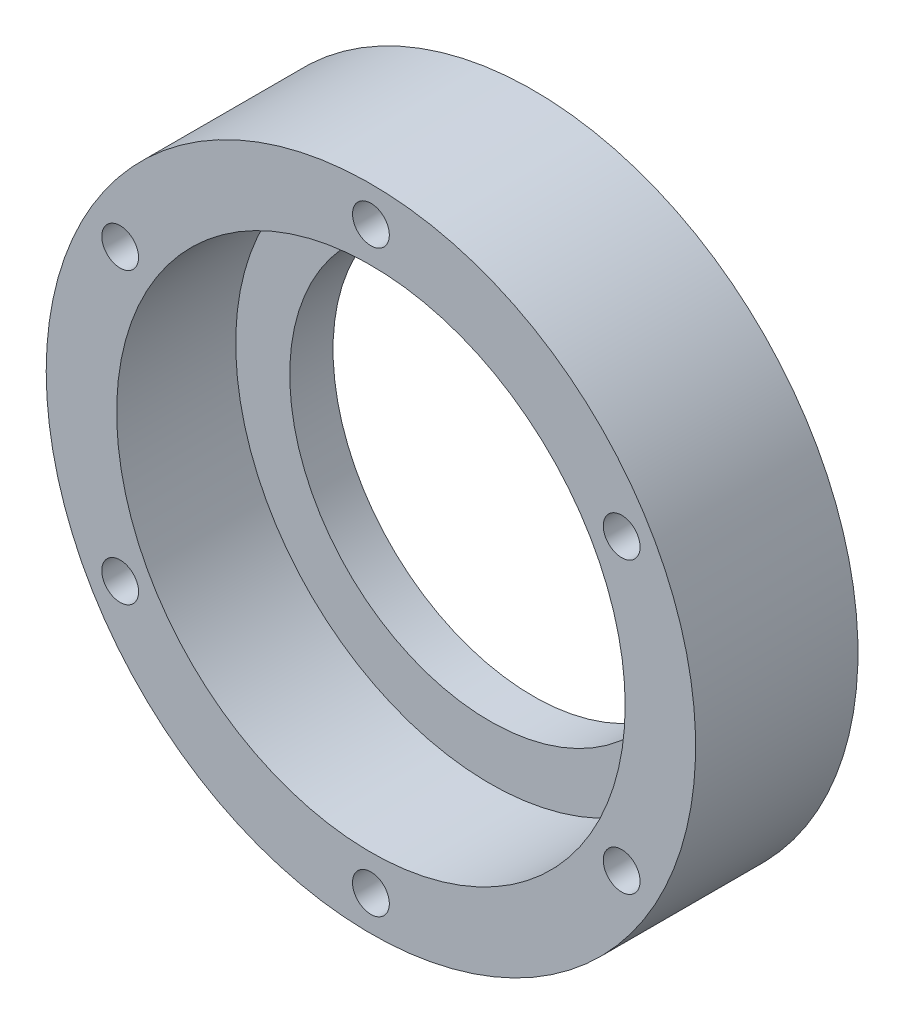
ISO-10303-21;
HEADER;
FILE_DESCRIPTION(('STEP AP214'),'2;1');
FILE_NAME('part.step','',(''),(''),'','','');
FILE_SCHEMA(('AUTOMOTIVE_DESIGN { 1 0 10303 214 1 1 1 1 }'));
ENDSEC;
DATA;
#1=APPLICATION_CONTEXT('core data for automotive mechanical design processes');
#2=APPLICATION_PROTOCOL_DEFINITION('international standard','automotive_design',2000,#1);
#3=PRODUCT_CONTEXT('',#1,'mechanical');
#4=PRODUCT('Part','Part','',(#3));
#5=PRODUCT_RELATED_PRODUCT_CATEGORY('part','',(#4));
#6=PRODUCT_DEFINITION_FORMATION('','',#4);
#7=PRODUCT_DEFINITION_CONTEXT('part definition',#1,'design');
#8=PRODUCT_DEFINITION('design','',#6,#7);
#9=PRODUCT_DEFINITION_SHAPE('','',#8);
#10=(LENGTH_UNIT() NAMED_UNIT(*) SI_UNIT(.MILLI.,.METRE.));
#11=(NAMED_UNIT(*) PLANE_ANGLE_UNIT() SI_UNIT($,.RADIAN.));
#12=(NAMED_UNIT(*) SI_UNIT($,.STERADIAN.) SOLID_ANGLE_UNIT());
#13=UNCERTAINTY_MEASURE_WITH_UNIT(LENGTH_MEASURE(1.E-05),#10,'distance_accuracy_value','');
#14=(GEOMETRIC_REPRESENTATION_CONTEXT(3) GLOBAL_UNCERTAINTY_ASSIGNED_CONTEXT((#13)) GLOBAL_UNIT_ASSIGNED_CONTEXT((#10,
#11,#12)) REPRESENTATION_CONTEXT('',''));
#15=CARTESIAN_POINT('',(0.,0.,0.));
#16=DIRECTION('',(0.,0.,1.));
#17=DIRECTION('',(1.,0.,0.));
#18=AXIS2_PLACEMENT_3D('',#15,#16,#17);
#19=CARTESIAN_POINT('',(0.,0.,15.));
#20=DIRECTION('',(0.,0.,-1.));
#21=DIRECTION('',(-1.,0.,0.));
#22=AXIS2_PLACEMENT_3D('',#19,#20,#21);
#23=CYLINDRICAL_SURFACE('',#22,30.);
#24=CARTESIAN_POINT('',(0.,0.,15.));
#25=DIRECTION('',(0.,0.,-1.));
#26=DIRECTION('',(-1.,0.,0.));
#27=AXIS2_PLACEMENT_3D('',#24,#25,#26);
#28=CIRCLE('',#27,30.);
#29=CARTESIAN_POINT('',(-30.,0.,15.));
#30=VERTEX_POINT('',#29);
#31=EDGE_CURVE('E75',#30,#30,#28,.T.);
#32=ORIENTED_EDGE('',*,*,#31,.T.);
#33=EDGE_LOOP('',(#32));
#34=FACE_BOUND('',#33,.T.);
#35=CARTESIAN_POINT('',(0.,0.,0.));
#36=DIRECTION('',(0.,0.,-1.));
#37=DIRECTION('',(-1.,0.,0.));
#38=AXIS2_PLACEMENT_3D('',#35,#36,#37);
#39=CIRCLE('',#38,30.);
#40=CARTESIAN_POINT('',(-30.,0.,0.));
#41=VERTEX_POINT('',#40);
#42=EDGE_CURVE('E78',#41,#41,#39,.T.);
#43=ORIENTED_EDGE('',*,*,#42,.F.);
#44=EDGE_LOOP('',(#43));
#45=FACE_BOUND('',#44,.T.);
#46=ADVANCED_FACE('F31',(#34,#45),#23,.T.);
#47=CARTESIAN_POINT('',(30.,0.,15.));
#48=DIRECTION('',(0.,0.,1.));
#49=DIRECTION('',(1.,0.,0.));
#50=AXIS2_PLACEMENT_3D('',#47,#48,#49);
#51=PLANE('',#50);
#52=CARTESIAN_POINT('',(0.,0.,15.));
#53=DIRECTION('',(0.,0.,1.));
#54=DIRECTION('',(1.,0.,0.));
#55=AXIS2_PLACEMENT_3D('',#52,#53,#54);
#56=CIRCLE('',#55,23.49119);
#57=CARTESIAN_POINT('',(23.49119,0.,15.));
#58=VERTEX_POINT('',#57);
#59=EDGE_CURVE('E108',#58,#58,#56,.T.);
#60=ORIENTED_EDGE('',*,*,#59,.F.);
#61=EDGE_LOOP('',(#60));
#62=FACE_BOUND('',#61,.T.);
#63=CARTESIAN_POINT('',(23.166179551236,-13.3749999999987,15.));
#64=DIRECTION('',(0.,0.,-1.));
#65=DIRECTION('',(-1.,0.,0.));
#66=AXIS2_PLACEMENT_3D('',#63,#64,#65);
#67=CIRCLE('',#66,1.69999999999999);
#68=CARTESIAN_POINT('',(21.466179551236,-13.3749999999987,15.));
#69=VERTEX_POINT('',#68);
#70=EDGE_CURVE('E96',#69,#69,#67,.T.);
#71=ORIENTED_EDGE('',*,*,#70,.T.);
#72=EDGE_LOOP('',(#71));
#73=FACE_BOUND('',#72,.T.);
#74=CARTESIAN_POINT('',(23.1661795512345,13.3750000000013,15.));
#75=DIRECTION('',(0.,0.,-1.));
#76=DIRECTION('',(-1.,0.,0.));
#77=AXIS2_PLACEMENT_3D('',#74,#75,#76);
#78=CIRCLE('',#77,1.69999999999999);
#79=CARTESIAN_POINT('',(21.4661795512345,13.3750000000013,15.));
#80=VERTEX_POINT('',#79);
#81=EDGE_CURVE('E93',#80,#80,#78,.T.);
#82=ORIENTED_EDGE('',*,*,#81,.T.);
#83=EDGE_LOOP('',(#82));
#84=FACE_BOUND('',#83,.T.);
#85=CARTESIAN_POINT('',(0.,26.75,15.));
#86=DIRECTION('',(0.,0.,-1.));
#87=DIRECTION('',(-1.,0.,0.));
#88=AXIS2_PLACEMENT_3D('',#85,#86,#87);
#89=CIRCLE('',#88,1.69999999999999);
#90=CARTESIAN_POINT('',(-1.69999999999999,26.75,15.));
#91=VERTEX_POINT('',#90);
#92=EDGE_CURVE('E90',#91,#91,#89,.T.);
#93=ORIENTED_EDGE('',*,*,#92,.T.);
#94=EDGE_LOOP('',(#93));
#95=FACE_BOUND('',#94,.T.);
#96=CARTESIAN_POINT('',(-23.1661795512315,-13.3750000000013,15.));
#97=DIRECTION('',(0.,0.,-1.));
#98=DIRECTION('',(-1.,0.,0.));
#99=AXIS2_PLACEMENT_3D('',#96,#97,#98);
#100=CIRCLE('',#99,1.69999999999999);
#101=CARTESIAN_POINT('',(-24.8661795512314,-13.3750000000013,15.));
#102=VERTEX_POINT('',#101);
#103=EDGE_CURVE('E87',#102,#102,#100,.T.);
#104=ORIENTED_EDGE('',*,*,#103,.T.);
#105=EDGE_LOOP('',(#104));
#106=FACE_BOUND('',#105,.T.);
#107=CARTESIAN_POINT('',(3.03457104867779E-12,-26.75,15.));
#108=DIRECTION('',(0.,0.,-1.));
#109=DIRECTION('',(-1.,0.,0.));
#110=AXIS2_PLACEMENT_3D('',#107,#108,#109);
#111=CIRCLE('',#110,1.69999999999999);
#112=CARTESIAN_POINT('',(-1.69999999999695,-26.75,15.));
#113=VERTEX_POINT('',#112);
#114=EDGE_CURVE('E84',#113,#113,#111,.T.);
#115=ORIENTED_EDGE('',*,*,#114,.T.);
#116=EDGE_LOOP('',(#115));
#117=FACE_BOUND('',#116,.T.);
#118=CARTESIAN_POINT('',(-23.166179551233,13.3749999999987,15.));
#119=DIRECTION('',(0.,0.,-1.));
#120=DIRECTION('',(-1.,0.,0.));
#121=AXIS2_PLACEMENT_3D('',#118,#119,#120);
#122=CIRCLE('',#121,1.69999999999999);
#123=CARTESIAN_POINT('',(-24.866179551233,13.3749999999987,15.));
#124=VERTEX_POINT('',#123);
#125=EDGE_CURVE('E81',#124,#124,#122,.T.);
#126=ORIENTED_EDGE('',*,*,#125,.T.);
#127=EDGE_LOOP('',(#126));
#128=FACE_BOUND('',#127,.T.);
#129=ORIENTED_EDGE('',*,*,#31,.F.);
#130=EDGE_LOOP('',(#129));
#131=FACE_BOUND('',#130,.T.);
#132=ADVANCED_FACE('F114',(#62,#73,#84,#95,#106,#117,#128,#131),#51,.T.);
#133=CARTESIAN_POINT('',(0.,0.,0.));
#134=DIRECTION('',(0.,0.,-1.));
#135=DIRECTION('',(-1.,0.,0.));
#136=AXIS2_PLACEMENT_3D('',#133,#134,#135);
#137=PLANE('',#136);
#138=CARTESIAN_POINT('',(-23.1661795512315,-13.3750000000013,0.));
#139=DIRECTION('',(0.,0.,-1.));
#140=DIRECTION('',(-1.,0.,0.));
#141=AXIS2_PLACEMENT_3D('',#138,#139,#140);
#142=CIRCLE('',#141,3.15000000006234);
#143=CARTESIAN_POINT('',(-26.3161795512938,-13.3750000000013,0.));
#144=VERTEX_POINT('',#143);
#145=EDGE_CURVE('E54',#144,#144,#142,.F.);
#146=ORIENTED_EDGE('',*,*,#145,.T.);
#147=EDGE_LOOP('',(#146));
#148=FACE_BOUND('',#147,.T.);
#149=CARTESIAN_POINT('',(-23.166179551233,13.3749999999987,0.));
#150=DIRECTION('',(0.,0.,-1.));
#151=DIRECTION('',(-1.,0.,0.));
#152=AXIS2_PLACEMENT_3D('',#149,#150,#151);
#153=CIRCLE('',#152,3.15000000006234);
#154=CARTESIAN_POINT('',(-26.3161795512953,13.3749999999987,0.));
#155=VERTEX_POINT('',#154);
#156=EDGE_CURVE('E57',#155,#155,#153,.F.);
#157=ORIENTED_EDGE('',*,*,#156,.T.);
#158=EDGE_LOOP('',(#157));
#159=FACE_BOUND('',#158,.T.);
#160=CARTESIAN_POINT('',(3.03457104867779E-12,-26.75,0.));
#161=DIRECTION('',(0.,0.,-1.));
#162=DIRECTION('',(-1.,0.,0.));
#163=AXIS2_PLACEMENT_3D('',#160,#161,#162);
#164=CIRCLE('',#163,3.15000000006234);
#165=CARTESIAN_POINT('',(-3.1500000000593,-26.75,0.));
#166=VERTEX_POINT('',#165);
#167=EDGE_CURVE('E60',#166,#166,#164,.F.);
#168=ORIENTED_EDGE('',*,*,#167,.T.);
#169=EDGE_LOOP('',(#168));
#170=FACE_BOUND('',#169,.T.);
#171=CARTESIAN_POINT('',(23.1661795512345,13.3750000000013,0.));
#172=DIRECTION('',(0.,0.,-1.));
#173=DIRECTION('',(-1.,0.,0.));
#174=AXIS2_PLACEMENT_3D('',#171,#172,#173);
#175=CIRCLE('',#174,3.15000000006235);
#176=CARTESIAN_POINT('',(20.0161795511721,13.3750000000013,0.));
#177=VERTEX_POINT('',#176);
#178=EDGE_CURVE('E63',#177,#177,#175,.F.);
#179=ORIENTED_EDGE('',*,*,#178,.T.);
#180=EDGE_LOOP('',(#179));
#181=FACE_BOUND('',#180,.T.);
#182=CARTESIAN_POINT('',(23.166179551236,-13.3749999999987,0.));
#183=DIRECTION('',(0.,0.,-1.));
#184=DIRECTION('',(-1.,0.,0.));
#185=AXIS2_PLACEMENT_3D('',#182,#183,#184);
#186=CIRCLE('',#185,3.15000000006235);
#187=CARTESIAN_POINT('',(20.0161795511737,-13.3749999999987,0.));
#188=VERTEX_POINT('',#187);
#189=EDGE_CURVE('E66',#188,#188,#186,.F.);
#190=ORIENTED_EDGE('',*,*,#189,.T.);
#191=EDGE_LOOP('',(#190));
#192=FACE_BOUND('',#191,.T.);
#193=CARTESIAN_POINT('',(0.,26.75,0.));
#194=DIRECTION('',(0.,0.,-1.));
#195=DIRECTION('',(-1.,0.,0.));
#196=AXIS2_PLACEMENT_3D('',#193,#194,#195);
#197=CIRCLE('',#196,3.15000000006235);
#198=CARTESIAN_POINT('',(-3.15000000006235,26.75,0.));
#199=VERTEX_POINT('',#198);
#200=EDGE_CURVE('E69',#199,#199,#197,.F.);
#201=ORIENTED_EDGE('',*,*,#200,.T.);
#202=EDGE_LOOP('',(#201));
#203=FACE_BOUND('',#202,.T.);
#204=CARTESIAN_POINT('',(0.,0.,0.));
#205=DIRECTION('',(0.,0.,1.));
#206=DIRECTION('',(1.,0.,0.));
#207=AXIS2_PLACEMENT_3D('',#204,#205,#206);
#208=CIRCLE('',#207,18.5);
#209=CARTESIAN_POINT('',(18.5,0.,0.));
#210=VERTEX_POINT('',#209);
#211=EDGE_CURVE('E99',#210,#210,#208,.T.);
#212=ORIENTED_EDGE('',*,*,#211,.T.);
#213=EDGE_LOOP('',(#212));
#214=FACE_BOUND('',#213,.T.);
#215=ORIENTED_EDGE('',*,*,#42,.T.);
#216=EDGE_LOOP('',(#215));
#217=FACE_BOUND('',#216,.T.);
#218=ADVANCED_FACE('F117',(#148,#159,#170,#181,#192,#203,#214,#217),#137,.T.);
#219=CARTESIAN_POINT('',(-23.166179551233,13.3749999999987,0.));
#220=DIRECTION('',(0.,0.,-1.));
#221=DIRECTION('',(-1.,0.,0.));
#222=AXIS2_PLACEMENT_3D('',#219,#220,#221);
#223=CYLINDRICAL_SURFACE('',#222,1.69999999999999);
#224=CARTESIAN_POINT('',(-23.166179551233,13.3749999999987,1.45000000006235));
#225=DIRECTION('',(0.,0.,-1.));
#226=DIRECTION('',(-1.,0.,0.));
#227=AXIS2_PLACEMENT_3D('',#224,#225,#226);
#228=CIRCLE('',#227,1.69999999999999);
#229=CARTESIAN_POINT('',(-24.866179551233,13.3749999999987,1.45000000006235));
#230=VERTEX_POINT('',#229);
#231=EDGE_CURVE('E51',#230,#230,#228,.T.);
#232=ORIENTED_EDGE('',*,*,#231,.T.);
#233=EDGE_LOOP('',(#232));
#234=FACE_BOUND('',#233,.T.);
#235=ORIENTED_EDGE('',*,*,#125,.F.);
#236=EDGE_LOOP('',(#235));
#237=FACE_BOUND('',#236,.T.);
#238=ADVANCED_FACE('F139',(#234,#237),#223,.F.);
#239=CARTESIAN_POINT('',(3.03457104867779E-12,-26.75,0.));
#240=DIRECTION('',(0.,0.,-1.));
#241=DIRECTION('',(-1.,0.,0.));
#242=AXIS2_PLACEMENT_3D('',#239,#240,#241);
#243=CYLINDRICAL_SURFACE('',#242,1.69999999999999);
#244=CARTESIAN_POINT('',(3.03457104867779E-12,-26.75,1.45000000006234));
#245=DIRECTION('',(0.,0.,-1.));
#246=DIRECTION('',(-1.,0.,0.));
#247=AXIS2_PLACEMENT_3D('',#244,#245,#246);
#248=CIRCLE('',#247,1.69999999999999);
#249=CARTESIAN_POINT('',(-1.69999999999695,-26.75,1.45000000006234));
#250=VERTEX_POINT('',#249);
#251=EDGE_CURVE('E46',#250,#250,#248,.T.);
#252=ORIENTED_EDGE('',*,*,#251,.T.);
#253=EDGE_LOOP('',(#252));
#254=FACE_BOUND('',#253,.T.);
#255=ORIENTED_EDGE('',*,*,#114,.F.);
#256=EDGE_LOOP('',(#255));
#257=FACE_BOUND('',#256,.T.);
#258=ADVANCED_FACE('F145',(#254,#257),#243,.F.);
#259=CARTESIAN_POINT('',(-23.1661795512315,-13.3750000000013,0.));
#260=DIRECTION('',(0.,0.,-1.));
#261=DIRECTION('',(-1.,0.,0.));
#262=AXIS2_PLACEMENT_3D('',#259,#260,#261);
#263=CYLINDRICAL_SURFACE('',#262,1.69999999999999);
#264=CARTESIAN_POINT('',(-23.1661795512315,-13.3750000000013,1.45000000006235));
#265=DIRECTION('',(0.,0.,-1.));
#266=DIRECTION('',(-1.,0.,0.));
#267=AXIS2_PLACEMENT_3D('',#264,#265,#266);
#268=CIRCLE('',#267,1.69999999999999);
#269=CARTESIAN_POINT('',(-24.8661795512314,-13.3750000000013,1.45000000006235));
#270=VERTEX_POINT('',#269);
#271=EDGE_CURVE('E72',#270,#270,#268,.T.);
#272=ORIENTED_EDGE('',*,*,#271,.T.);
#273=EDGE_LOOP('',(#272));
#274=FACE_BOUND('',#273,.T.);
#275=ORIENTED_EDGE('',*,*,#103,.F.);
#276=EDGE_LOOP('',(#275));
#277=FACE_BOUND('',#276,.T.);
#278=ADVANCED_FACE('F208',(#274,#277),#263,.F.);
#279=CARTESIAN_POINT('',(0.,26.75,0.));
#280=DIRECTION('',(0.,0.,-1.));
#281=DIRECTION('',(-1.,0.,0.));
#282=AXIS2_PLACEMENT_3D('',#279,#280,#281);
#283=CYLINDRICAL_SURFACE('',#282,1.69999999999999);
#284=CARTESIAN_POINT('',(0.,26.75,1.45000000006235));
#285=DIRECTION('',(0.,0.,-1.));
#286=DIRECTION('',(-1.,0.,0.));
#287=AXIS2_PLACEMENT_3D('',#284,#285,#286);
#288=CIRCLE('',#287,1.69999999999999);
#289=CARTESIAN_POINT('',(-1.69999999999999,26.75,1.45000000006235));
#290=VERTEX_POINT('',#289);
#291=EDGE_CURVE('E10',#290,#290,#288,.T.);
#292=ORIENTED_EDGE('',*,*,#291,.T.);
#293=EDGE_LOOP('',(#292));
#294=FACE_BOUND('',#293,.T.);
#295=ORIENTED_EDGE('',*,*,#92,.F.);
#296=EDGE_LOOP('',(#295));
#297=FACE_BOUND('',#296,.T.);
#298=ADVANCED_FACE('F204',(#294,#297),#283,.F.);
#299=CARTESIAN_POINT('',(23.1661795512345,13.3750000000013,0.));
#300=DIRECTION('',(0.,0.,-1.));
#301=DIRECTION('',(-1.,0.,0.));
#302=AXIS2_PLACEMENT_3D('',#299,#300,#301);
#303=CYLINDRICAL_SURFACE('',#302,1.69999999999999);
#304=CARTESIAN_POINT('',(23.1661795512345,13.3750000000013,1.45000000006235));
#305=DIRECTION('',(0.,0.,-1.));
#306=DIRECTION('',(-1.,0.,0.));
#307=AXIS2_PLACEMENT_3D('',#304,#305,#306);
#308=CIRCLE('',#307,1.69999999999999);
#309=CARTESIAN_POINT('',(21.4661795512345,13.3750000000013,1.45000000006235));
#310=VERTEX_POINT('',#309);
#311=EDGE_CURVE('E42',#310,#310,#308,.T.);
#312=ORIENTED_EDGE('',*,*,#311,.T.);
#313=EDGE_LOOP('',(#312));
#314=FACE_BOUND('',#313,.T.);
#315=ORIENTED_EDGE('',*,*,#81,.F.);
#316=EDGE_LOOP('',(#315));
#317=FACE_BOUND('',#316,.T.);
#318=ADVANCED_FACE('F201',(#314,#317),#303,.F.);
#319=CARTESIAN_POINT('',(23.166179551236,-13.3749999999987,0.));
#320=DIRECTION('',(0.,0.,-1.));
#321=DIRECTION('',(-1.,0.,0.));
#322=AXIS2_PLACEMENT_3D('',#319,#320,#321);
#323=CYLINDRICAL_SURFACE('',#322,1.69999999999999);
#324=CARTESIAN_POINT('',(23.166179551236,-13.3749999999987,1.45000000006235));
#325=DIRECTION('',(0.,0.,-1.));
#326=DIRECTION('',(-1.,0.,0.));
#327=AXIS2_PLACEMENT_3D('',#324,#325,#326);
#328=CIRCLE('',#327,1.69999999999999);
#329=CARTESIAN_POINT('',(21.466179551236,-13.3749999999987,1.45000000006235));
#330=VERTEX_POINT('',#329);
#331=EDGE_CURVE('E38',#330,#330,#328,.T.);
#332=ORIENTED_EDGE('',*,*,#331,.T.);
#333=EDGE_LOOP('',(#332));
#334=FACE_BOUND('',#333,.T.);
#335=ORIENTED_EDGE('',*,*,#70,.F.);
#336=EDGE_LOOP('',(#335));
#337=FACE_BOUND('',#336,.T.);
#338=ADVANCED_FACE('F185',(#334,#337),#323,.F.);
#339=CARTESIAN_POINT('',(0.,0.,15.));
#340=DIRECTION('',(0.,0.,1.));
#341=DIRECTION('',(1.,0.,0.));
#342=AXIS2_PLACEMENT_3D('',#339,#340,#341);
#343=CYLINDRICAL_SURFACE('',#342,18.5);
#344=ORIENTED_EDGE('',*,*,#211,.F.);
#345=EDGE_LOOP('',(#344));
#346=FACE_BOUND('',#345,.T.);
#347=CARTESIAN_POINT('',(0.,0.,4.));
#348=DIRECTION('',(0.,0.,1.));
#349=DIRECTION('',(1.,0.,0.));
#350=AXIS2_PLACEMENT_3D('',#347,#348,#349);
#351=CIRCLE('',#350,18.5);
#352=CARTESIAN_POINT('',(18.5,0.,4.));
#353=VERTEX_POINT('',#352);
#354=EDGE_CURVE('E102',#353,#353,#351,.T.);
#355=ORIENTED_EDGE('',*,*,#354,.T.);
#356=EDGE_LOOP('',(#355));
#357=FACE_BOUND('',#356,.T.);
#358=ADVANCED_FACE('F181',(#346,#357),#343,.F.);
#359=CARTESIAN_POINT('',(18.5,0.,4.));
#360=DIRECTION('',(0.,0.,-1.));
#361=DIRECTION('',(-1.,0.,0.));
#362=AXIS2_PLACEMENT_3D('',#359,#360,#361);
#363=PLANE('',#362);
#364=ORIENTED_EDGE('',*,*,#354,.F.);
#365=EDGE_LOOP('',(#364));
#366=FACE_BOUND('',#365,.T.);
#367=CARTESIAN_POINT('',(0.,0.,4.));
#368=DIRECTION('',(0.,0.,1.));
#369=DIRECTION('',(1.,0.,0.));
#370=AXIS2_PLACEMENT_3D('',#367,#368,#369);
#371=CIRCLE('',#370,23.49119);
#372=CARTESIAN_POINT('',(23.49119,0.,4.));
#373=VERTEX_POINT('',#372);
#374=EDGE_CURVE('E105',#373,#373,#371,.T.);
#375=ORIENTED_EDGE('',*,*,#374,.T.);
#376=EDGE_LOOP('',(#375));
#377=FACE_BOUND('',#376,.T.);
#378=ADVANCED_FACE('F184',(#366,#377),#363,.F.);
#379=CARTESIAN_POINT('',(0.,0.,15.));
#380=DIRECTION('',(0.,0.,1.));
#381=DIRECTION('',(1.,0.,0.));
#382=AXIS2_PLACEMENT_3D('',#379,#380,#381);
#383=CYLINDRICAL_SURFACE('',#382,23.49119);
#384=ORIENTED_EDGE('',*,*,#374,.F.);
#385=EDGE_LOOP('',(#384));
#386=FACE_BOUND('',#385,.T.);
#387=ORIENTED_EDGE('',*,*,#59,.T.);
#388=EDGE_LOOP('',(#387));
#389=FACE_BOUND('',#388,.T.);
#390=ADVANCED_FACE('F112',(#386,#389),#383,.F.);
#391=CARTESIAN_POINT('',(-23.1661795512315,-13.3750000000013,1.45000000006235));
#392=DIRECTION('',(0.,0.,-1.));
#393=DIRECTION('',(-1.,0.,0.));
#394=AXIS2_PLACEMENT_3D('',#391,#392,#393);
#395=CONICAL_SURFACE('',#394,1.69999999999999,0.78539816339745);
#396=CARTESIAN_POINT('',(-26.3161795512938,-13.3750000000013,0.));
#397=CARTESIAN_POINT('',(-26.3010753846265,-13.3750000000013,0.0151041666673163));
#398=CARTESIAN_POINT('',(-26.2859712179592,-13.3750000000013,0.0302083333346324));
#399=CARTESIAN_POINT('',(-26.2557628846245,-13.3750000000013,0.0604166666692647));
#400=CARTESIAN_POINT('',(-26.2406587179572,-13.3750000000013,0.0755208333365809));
#401=CARTESIAN_POINT('',(-26.2104503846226,-13.3750000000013,0.105729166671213));
#402=CARTESIAN_POINT('',(-26.1953462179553,-13.3750000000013,0.120833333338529));
#403=CARTESIAN_POINT('',(-26.1651378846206,-13.3750000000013,0.151041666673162));
#404=CARTESIAN_POINT('',(-26.1500337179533,-13.3750000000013,0.166145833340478));
#405=CARTESIAN_POINT('',(-26.1198253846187,-13.3750000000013,0.19635416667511));
#406=CARTESIAN_POINT('',(-26.1047212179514,-13.3750000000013,0.211458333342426));
#407=CARTESIAN_POINT('',(-26.0745128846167,-13.3750000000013,0.241666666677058));
#408=CARTESIAN_POINT('',(-26.0594087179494,-13.3750000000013,0.256770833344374));
#409=CARTESIAN_POINT('',(-26.0292003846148,-13.3750000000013,0.286979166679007));
#410=CARTESIAN_POINT('',(-26.0140962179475,-13.3750000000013,0.302083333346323));
#411=CARTESIAN_POINT('',(-25.9838878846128,-13.3750000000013,0.332291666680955));
#412=CARTESIAN_POINT('',(-25.9687837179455,-13.3750000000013,0.347395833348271));
#413=CARTESIAN_POINT('',(-25.9385753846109,-13.3750000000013,0.377604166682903));
#414=CARTESIAN_POINT('',(-25.9234712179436,-13.3750000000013,0.39270833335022));
#415=CARTESIAN_POINT('',(-25.8932628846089,-13.3750000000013,0.422916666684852));
#416=CARTESIAN_POINT('',(-25.8781587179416,-13.3750000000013,0.438020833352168));
#417=CARTESIAN_POINT('',(-25.847950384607,-13.3750000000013,0.4682291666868));
#418=CARTESIAN_POINT('',(-25.8328462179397,-13.3750000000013,0.483333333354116));
#419=CARTESIAN_POINT('',(-25.802637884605,-13.3750000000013,0.513541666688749));
#420=CARTESIAN_POINT('',(-25.7875337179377,-13.3750000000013,0.528645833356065));
#421=CARTESIAN_POINT('',(-25.7573253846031,-13.3750000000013,0.558854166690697));
#422=CARTESIAN_POINT('',(-25.7422212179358,-13.3750000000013,0.573958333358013));
#423=CARTESIAN_POINT('',(-25.7120128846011,-13.3750000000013,0.604166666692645));
#424=CARTESIAN_POINT('',(-25.6969087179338,-13.3750000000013,0.619270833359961));
#425=CARTESIAN_POINT('',(-25.6667003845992,-13.3750000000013,0.649479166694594));
#426=CARTESIAN_POINT('',(-25.6515962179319,-13.3750000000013,0.66458333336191));
#427=CARTESIAN_POINT('',(-25.6213878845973,-13.3750000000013,0.694791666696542));
#428=CARTESIAN_POINT('',(-25.6062837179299,-13.3750000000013,0.709895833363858));
#429=CARTESIAN_POINT('',(-25.5760753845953,-13.3750000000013,0.74010416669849));
#430=CARTESIAN_POINT('',(-25.560971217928,-13.3750000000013,0.755208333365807));
#431=CARTESIAN_POINT('',(-25.5307628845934,-13.3750000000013,0.785416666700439));
#432=CARTESIAN_POINT('',(-25.515658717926,-13.3750000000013,0.800520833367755));
#433=CARTESIAN_POINT('',(-25.4854503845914,-13.3750000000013,0.830729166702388));
#434=CARTESIAN_POINT('',(-25.4703462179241,-13.3750000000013,0.845833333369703));
#435=CARTESIAN_POINT('',(-25.4401378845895,-13.3750000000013,0.876041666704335));
#436=CARTESIAN_POINT('',(-25.4250337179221,-13.3750000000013,0.891145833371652));
#437=CARTESIAN_POINT('',(-25.3948253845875,-13.3750000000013,0.921354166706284));
#438=CARTESIAN_POINT('',(-25.3797212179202,-13.3750000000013,0.9364583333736));
#439=CARTESIAN_POINT('',(-25.3495128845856,-13.3750000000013,0.966666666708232));
#440=CARTESIAN_POINT('',(-25.3344087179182,-13.3750000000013,0.981770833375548));
#441=CARTESIAN_POINT('',(-25.3042003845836,-13.3750000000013,1.01197916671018));
#442=CARTESIAN_POINT('',(-25.2890962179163,-13.3750000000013,1.0270833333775));
#443=CARTESIAN_POINT('',(-25.2588878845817,-13.3750000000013,1.05729166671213));
#444=CARTESIAN_POINT('',(-25.2437837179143,-13.3750000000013,1.07239583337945));
#445=CARTESIAN_POINT('',(-25.2135753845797,-13.3750000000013,1.10260416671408));
#446=CARTESIAN_POINT('',(-25.1984712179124,-13.3750000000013,1.11770833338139));
#447=CARTESIAN_POINT('',(-25.1682628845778,-13.3750000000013,1.14791666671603));
#448=CARTESIAN_POINT('',(-25.1531587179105,-13.3750000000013,1.16302083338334));
#449=CARTESIAN_POINT('',(-25.1229503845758,-13.3750000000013,1.19322916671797));
#450=CARTESIAN_POINT('',(-25.1078462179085,-13.3750000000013,1.20833333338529));
#451=CARTESIAN_POINT('',(-25.0776378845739,-13.3750000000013,1.23854166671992));
#452=CARTESIAN_POINT('',(-25.0625337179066,-13.3750000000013,1.25364583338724));
#453=CARTESIAN_POINT('',(-25.0323253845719,-13.3750000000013,1.28385416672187));
#454=CARTESIAN_POINT('',(-25.0172212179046,-13.3750000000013,1.29895833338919));
#455=CARTESIAN_POINT('',(-24.98701288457,-13.3750000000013,1.32916666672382));
#456=CARTESIAN_POINT('',(-24.9719087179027,-13.3750000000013,1.34427083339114));
#457=CARTESIAN_POINT('',(-24.941700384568,-13.3750000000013,1.37447916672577));
#458=CARTESIAN_POINT('',(-24.9265962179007,-13.3750000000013,1.38958333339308));
#459=CARTESIAN_POINT('',(-24.8963878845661,-13.3750000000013,1.41979166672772));
#460=CARTESIAN_POINT('',(-24.8812837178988,-13.3750000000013,1.43489583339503));
#461=CARTESIAN_POINT('',(-24.8661795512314,-13.3750000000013,1.45000000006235));
#462=B_SPLINE_CURVE_WITH_KNOTS('',3,(#396,#397,#398,#399,#400,#401,#402,#403,#404,#405,#406,
#407,#408,#409,#410,#411,#412,#413,#414,#415,#416,#417,#418,#419,#420,#421,#422,#423,#424,#425,
#426,#427,#428,#429,#430,#431,#432,#433,#434,#435,#436,#437,#438,#439,#440,#441,#442,#443,#444,
#445,#446,#447,#448,#449,#450,#451,#452,#453,#454,#455,#456,#457,#458,#459,#460,#461),
.UNSPECIFIED.,.F.,.F.,(4,2,2,2,2,2,2,2,2,2,2,2,2,2,2,2,2,2,2,2,2,2,2,2,2,2,2,2,2,2,2,2,4),(0.,
0.0640815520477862,0.128163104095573,0.192244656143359,0.256326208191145,0.320407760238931,
0.384489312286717,0.448570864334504,0.512652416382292,0.576733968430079,0.640815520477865,
0.704897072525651,0.768978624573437,0.833060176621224,0.89714172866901,0.961223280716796,
1.02530483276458,1.08938638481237,1.15346793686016,1.21754948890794,1.28163104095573,
1.34571259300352,1.4097941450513,1.47387569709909,1.53795724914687,1.60203880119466,
1.66612035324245,1.73020190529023,1.79428345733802,1.85836500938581,1.92244656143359,
1.98652811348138,2.05060966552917),.UNSPECIFIED.);
#463=EDGE_CURVE('BSEAM151',#144,#270,#462,.T.);
#464=ORIENTED_EDGE('',*,*,#145,.F.);
#465=ORIENTED_EDGE('',*,*,#271,.F.);
#466=ORIENTED_EDGE('',*,*,#463,.T.);
#467=ORIENTED_EDGE('',*,*,#463,.F.);
#468=EDGE_LOOP('',(#464,#466,#465,#467));
#469=FACE_BOUND('',#468,.T.);
#470=ADVANCED_FACE('F151',(#469),#395,.F.);
#471=CARTESIAN_POINT('',(-23.166179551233,13.3749999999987,1.45000000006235));
#472=DIRECTION('',(0.,0.,-1.));
#473=DIRECTION('',(-1.,0.,0.));
#474=AXIS2_PLACEMENT_3D('',#471,#472,#473);
#475=CONICAL_SURFACE('',#474,1.69999999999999,0.78539816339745);
#476=CARTESIAN_POINT('',(-26.3161795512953,13.3749999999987,0.));
#477=CARTESIAN_POINT('',(-26.301075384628,13.3749999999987,0.0151041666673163));
#478=CARTESIAN_POINT('',(-26.2859712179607,13.3749999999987,0.0302083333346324));
#479=CARTESIAN_POINT('',(-26.2557628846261,13.3749999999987,0.0604166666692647));
#480=CARTESIAN_POINT('',(-26.2406587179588,13.3749999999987,0.0755208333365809));
#481=CARTESIAN_POINT('',(-26.2104503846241,13.3749999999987,0.105729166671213));
#482=CARTESIAN_POINT('',(-26.1953462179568,13.3749999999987,0.120833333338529));
#483=CARTESIAN_POINT('',(-26.1651378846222,13.3749999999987,0.151041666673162));
#484=CARTESIAN_POINT('',(-26.1500337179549,13.3749999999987,0.166145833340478));
#485=CARTESIAN_POINT('',(-26.1198253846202,13.3749999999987,0.19635416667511));
#486=CARTESIAN_POINT('',(-26.1047212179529,13.3749999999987,0.211458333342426));
#487=CARTESIAN_POINT('',(-26.0745128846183,13.3749999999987,0.241666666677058));
#488=CARTESIAN_POINT('',(-26.059408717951,13.3749999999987,0.256770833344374));
#489=CARTESIAN_POINT('',(-26.0292003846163,13.3749999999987,0.286979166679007));
#490=CARTESIAN_POINT('',(-26.014096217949,13.3749999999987,0.302083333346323));
#491=CARTESIAN_POINT('',(-25.9838878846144,13.3749999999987,0.332291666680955));
#492=CARTESIAN_POINT('',(-25.9687837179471,13.3749999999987,0.347395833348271));
#493=CARTESIAN_POINT('',(-25.9385753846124,13.3749999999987,0.377604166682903));
#494=CARTESIAN_POINT('',(-25.9234712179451,13.3749999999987,0.39270833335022));
#495=CARTESIAN_POINT('',(-25.8932628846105,13.3749999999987,0.422916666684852));
#496=CARTESIAN_POINT('',(-25.8781587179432,13.3749999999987,0.438020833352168));
#497=CARTESIAN_POINT('',(-25.8479503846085,13.3749999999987,0.4682291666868));
#498=CARTESIAN_POINT('',(-25.8328462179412,13.3749999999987,0.483333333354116));
#499=CARTESIAN_POINT('',(-25.8026378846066,13.3749999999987,0.513541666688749));
#500=CARTESIAN_POINT('',(-25.7875337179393,13.3749999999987,0.528645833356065));
#501=CARTESIAN_POINT('',(-25.7573253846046,13.3749999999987,0.558854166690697));
#502=CARTESIAN_POINT('',(-25.7422212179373,13.3749999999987,0.573958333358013));
#503=CARTESIAN_POINT('',(-25.7120128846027,13.3749999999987,0.604166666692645));
#504=CARTESIAN_POINT('',(-25.6969087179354,13.3749999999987,0.619270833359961));
#505=CARTESIAN_POINT('',(-25.6667003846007,13.3749999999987,0.649479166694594));
#506=CARTESIAN_POINT('',(-25.6515962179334,13.3749999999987,0.66458333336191));
#507=CARTESIAN_POINT('',(-25.6213878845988,13.3749999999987,0.694791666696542));
#508=CARTESIAN_POINT('',(-25.6062837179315,13.3749999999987,0.709895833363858));
#509=CARTESIAN_POINT('',(-25.5760753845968,13.3749999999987,0.74010416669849));
#510=CARTESIAN_POINT('',(-25.5609712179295,13.3749999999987,0.755208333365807));
#511=CARTESIAN_POINT('',(-25.5307628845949,13.3749999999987,0.785416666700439));
#512=CARTESIAN_POINT('',(-25.5156587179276,13.3749999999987,0.800520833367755));
#513=CARTESIAN_POINT('',(-25.4854503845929,13.3749999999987,0.830729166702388));
#514=CARTESIAN_POINT('',(-25.4703462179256,13.3749999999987,0.845833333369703));
#515=CARTESIAN_POINT('',(-25.440137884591,13.3749999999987,0.876041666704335));
#516=CARTESIAN_POINT('',(-25.4250337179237,13.3749999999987,0.891145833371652));
#517=CARTESIAN_POINT('',(-25.394825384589,13.3749999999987,0.921354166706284));
#518=CARTESIAN_POINT('',(-25.3797212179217,13.3749999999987,0.9364583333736));
#519=CARTESIAN_POINT('',(-25.3495128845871,13.3749999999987,0.966666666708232));
#520=CARTESIAN_POINT('',(-25.3344087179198,13.3749999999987,0.981770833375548));
#521=CARTESIAN_POINT('',(-25.3042003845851,13.3749999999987,1.01197916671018));
#522=CARTESIAN_POINT('',(-25.2890962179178,13.3749999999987,1.0270833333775));
#523=CARTESIAN_POINT('',(-25.2588878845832,13.3749999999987,1.05729166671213));
#524=CARTESIAN_POINT('',(-25.2437837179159,13.3749999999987,1.07239583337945));
#525=CARTESIAN_POINT('',(-25.2135753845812,13.3749999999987,1.10260416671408));
#526=CARTESIAN_POINT('',(-25.1984712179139,13.3749999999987,1.11770833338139));
#527=CARTESIAN_POINT('',(-25.1682628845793,13.3749999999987,1.14791666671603));
#528=CARTESIAN_POINT('',(-25.153158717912,13.3749999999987,1.16302083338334));
#529=CARTESIAN_POINT('',(-25.1229503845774,13.3749999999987,1.19322916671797));
#530=CARTESIAN_POINT('',(-25.10784621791,13.3749999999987,1.20833333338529));
#531=CARTESIAN_POINT('',(-25.0776378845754,13.3749999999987,1.23854166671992));
#532=CARTESIAN_POINT('',(-25.0625337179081,13.3749999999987,1.25364583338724));
#533=CARTESIAN_POINT('',(-25.0323253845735,13.3749999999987,1.28385416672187));
#534=CARTESIAN_POINT('',(-25.0172212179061,13.3749999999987,1.29895833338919));
#535=CARTESIAN_POINT('',(-24.9870128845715,13.3749999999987,1.32916666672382));
#536=CARTESIAN_POINT('',(-24.9719087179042,13.3749999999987,1.34427083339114));
#537=CARTESIAN_POINT('',(-24.9417003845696,13.3749999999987,1.37447916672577));
#538=CARTESIAN_POINT('',(-24.9265962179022,13.3749999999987,1.38958333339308));
#539=CARTESIAN_POINT('',(-24.8963878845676,13.3749999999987,1.41979166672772));
#540=CARTESIAN_POINT('',(-24.8812837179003,13.3749999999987,1.43489583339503));
#541=CARTESIAN_POINT('',(-24.866179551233,13.3749999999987,1.45000000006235));
#542=B_SPLINE_CURVE_WITH_KNOTS('',3,(#476,#477,#478,#479,#480,#481,#482,#483,#484,#485,#486,
#487,#488,#489,#490,#491,#492,#493,#494,#495,#496,#497,#498,#499,#500,#501,#502,#503,#504,#505,
#506,#507,#508,#509,#510,#511,#512,#513,#514,#515,#516,#517,#518,#519,#520,#521,#522,#523,#524,
#525,#526,#527,#528,#529,#530,#531,#532,#533,#534,#535,#536,#537,#538,#539,#540,#541),
.UNSPECIFIED.,.F.,.F.,(4,2,2,2,2,2,2,2,2,2,2,2,2,2,2,2,2,2,2,2,2,2,2,2,2,2,2,2,2,2,2,2,4),(0.,
0.0640815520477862,0.128163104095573,0.192244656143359,0.256326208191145,0.320407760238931,
0.384489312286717,0.448570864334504,0.512652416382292,0.576733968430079,0.640815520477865,
0.704897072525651,0.768978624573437,0.833060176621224,0.89714172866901,0.961223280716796,
1.02530483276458,1.08938638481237,1.15346793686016,1.21754948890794,1.28163104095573,
1.34571259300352,1.4097941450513,1.47387569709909,1.53795724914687,1.60203880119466,
1.66612035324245,1.73020190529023,1.79428345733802,1.85836500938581,1.92244656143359,
1.98652811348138,2.05060966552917),.UNSPECIFIED.);
#543=EDGE_CURVE('BSEAM154',#155,#230,#542,.T.);
#544=ORIENTED_EDGE('',*,*,#156,.F.);
#545=ORIENTED_EDGE('',*,*,#231,.F.);
#546=ORIENTED_EDGE('',*,*,#543,.T.);
#547=ORIENTED_EDGE('',*,*,#543,.F.);
#548=EDGE_LOOP('',(#544,#546,#545,#547));
#549=FACE_BOUND('',#548,.T.);
#550=ADVANCED_FACE('F154',(#549),#475,.F.);
#551=CARTESIAN_POINT('',(3.03457104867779E-12,-26.75,1.45000000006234));
#552=DIRECTION('',(0.,0.,-1.));
#553=DIRECTION('',(-1.,0.,0.));
#554=AXIS2_PLACEMENT_3D('',#551,#552,#553);
#555=CONICAL_SURFACE('',#554,1.69999999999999,0.785398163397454);
#556=ORIENTED_EDGE('',*,*,#167,.F.);
#557=EDGE_LOOP('',(#556));
#558=FACE_BOUND('',#557,.T.);
#559=ORIENTED_EDGE('',*,*,#251,.F.);
#560=EDGE_LOOP('',(#559));
#561=FACE_BOUND('',#560,.T.);
#562=ADVANCED_FACE('F158',(#558,#561),#555,.F.);
#563=CARTESIAN_POINT('',(23.1661795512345,13.3750000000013,1.45000000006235));
#564=DIRECTION('',(0.,0.,-1.));
#565=DIRECTION('',(-1.,0.,0.));
#566=AXIS2_PLACEMENT_3D('',#563,#564,#565);
#567=CONICAL_SURFACE('',#566,1.69999999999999,0.785398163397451);
#568=ORIENTED_EDGE('',*,*,#178,.F.);
#569=EDGE_LOOP('',(#568));
#570=FACE_BOUND('',#569,.T.);
#571=ORIENTED_EDGE('',*,*,#311,.F.);
#572=EDGE_LOOP('',(#571));
#573=FACE_BOUND('',#572,.T.);
#574=ADVANCED_FACE('F162',(#570,#573),#567,.F.);
#575=CARTESIAN_POINT('',(23.166179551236,-13.3749999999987,1.45000000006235));
#576=DIRECTION('',(0.,0.,-1.));
#577=DIRECTION('',(-1.,0.,0.));
#578=AXIS2_PLACEMENT_3D('',#575,#576,#577);
#579=CONICAL_SURFACE('',#578,1.69999999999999,0.785398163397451);
#580=ORIENTED_EDGE('',*,*,#189,.F.);
#581=EDGE_LOOP('',(#580));
#582=FACE_BOUND('',#581,.T.);
#583=ORIENTED_EDGE('',*,*,#331,.F.);
#584=EDGE_LOOP('',(#583));
#585=FACE_BOUND('',#584,.T.);
#586=ADVANCED_FACE('F165',(#582,#585),#579,.F.);
#587=CARTESIAN_POINT('',(0.,26.75,1.45000000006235));
#588=DIRECTION('',(0.,0.,-1.));
#589=DIRECTION('',(-1.,0.,0.));
#590=AXIS2_PLACEMENT_3D('',#587,#588,#589);
#591=CONICAL_SURFACE('',#590,1.69999999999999,0.785398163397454);
#592=ORIENTED_EDGE('',*,*,#200,.F.);
#593=EDGE_LOOP('',(#592));
#594=FACE_BOUND('',#593,.T.);
#595=ORIENTED_EDGE('',*,*,#291,.F.);
#596=EDGE_LOOP('',(#595));
#597=FACE_BOUND('',#596,.T.);
#598=ADVANCED_FACE('F33',(#594,#597),#591,.F.);
#599=CLOSED_SHELL('',(#46,#132,#218,#238,#258,#278,#298,#318,#338,#358,#378,#390,#470,#550,#562,
#574,#586,#598));
#600=MANIFOLD_SOLID_BREP('B2',#599);
#601=ADVANCED_BREP_SHAPE_REPRESENTATION('',(#18,#600),#14);
#602=SHAPE_DEFINITION_REPRESENTATION(#9,#601);
ENDSEC;
END-ISO-10303-21;
